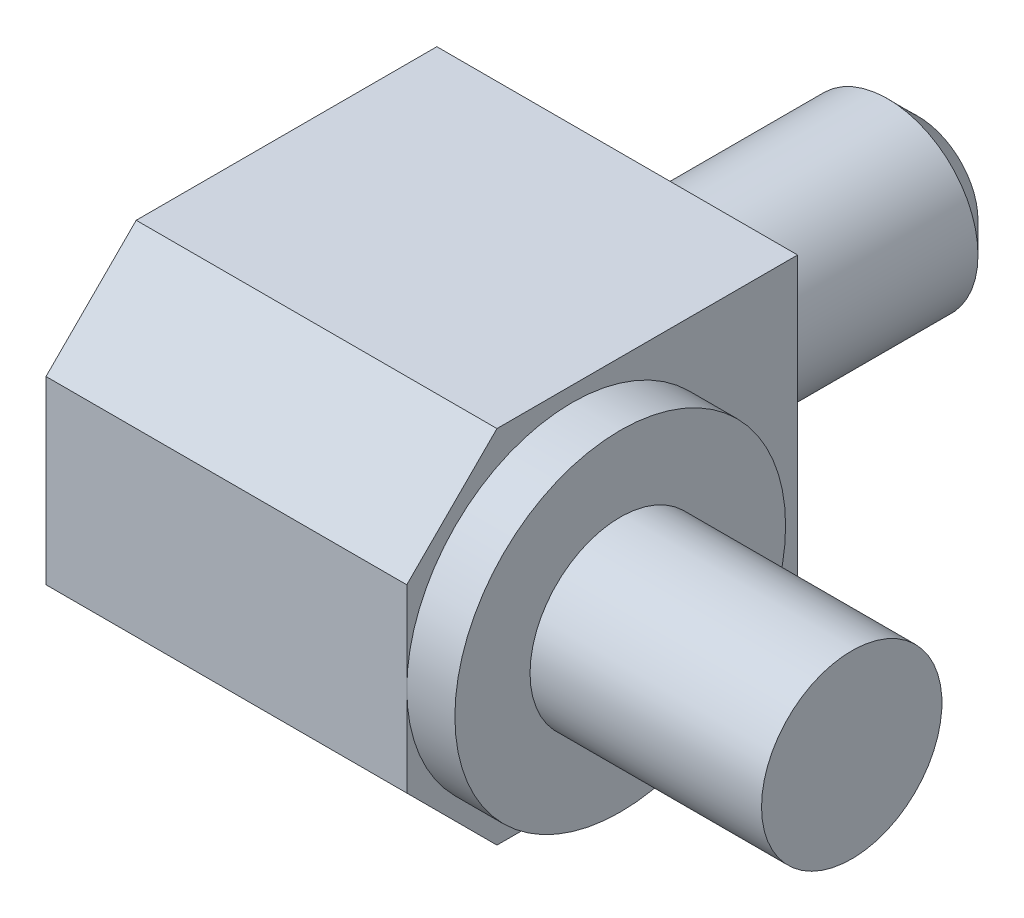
ISO-10303-21;
HEADER;
FILE_DESCRIPTION(('STEP AP214'),'2;1');
FILE_NAME('part.step','',(''),(''),'','','');
FILE_SCHEMA(('AUTOMOTIVE_DESIGN { 1 0 10303 214 1 1 1 1 }'));
ENDSEC;
DATA;
#1=APPLICATION_CONTEXT('core data for automotive mechanical design processes');
#2=APPLICATION_PROTOCOL_DEFINITION('international standard','automotive_design',2000,#1);
#3=PRODUCT_CONTEXT('',#1,'mechanical');
#4=PRODUCT('Part','Part','',(#3));
#5=PRODUCT_RELATED_PRODUCT_CATEGORY('part','',(#4));
#6=PRODUCT_DEFINITION_FORMATION('','',#4);
#7=PRODUCT_DEFINITION_CONTEXT('part definition',#1,'design');
#8=PRODUCT_DEFINITION('design','',#6,#7);
#9=PRODUCT_DEFINITION_SHAPE('','',#8);
#10=(LENGTH_UNIT() NAMED_UNIT(*) SI_UNIT(.MILLI.,.METRE.));
#11=(NAMED_UNIT(*) PLANE_ANGLE_UNIT() SI_UNIT($,.RADIAN.));
#12=(NAMED_UNIT(*) SI_UNIT($,.STERADIAN.) SOLID_ANGLE_UNIT());
#13=UNCERTAINTY_MEASURE_WITH_UNIT(LENGTH_MEASURE(1.E-05),#10,'distance_accuracy_value','');
#14=(GEOMETRIC_REPRESENTATION_CONTEXT(3) GLOBAL_UNCERTAINTY_ASSIGNED_CONTEXT((#13)) GLOBAL_UNIT_ASSIGNED_CONTEXT((#10,
#11,#12)) REPRESENTATION_CONTEXT('',''));
#15=CARTESIAN_POINT('',(0.,0.,0.));
#16=DIRECTION('',(0.,0.,1.));
#17=DIRECTION('',(1.,0.,0.));
#18=AXIS2_PLACEMENT_3D('',#15,#16,#17);
#19=CARTESIAN_POINT('',(6.,0.,0.));
#20=DIRECTION('',(1.,0.,0.));
#21=DIRECTION('',(0.,0.,-1.));
#22=AXIS2_PLACEMENT_3D('',#19,#20,#21);
#23=PLANE('',#22);
#24=DIRECTION('',(0.,1.,0.));
#25=VECTOR('',#24,1.);
#26=CARTESIAN_POINT('',(6.,-6.,13.));
#27=LINE('',#26,#25);
#28=CARTESIAN_POINT('',(6.,0.,13.));
#29=VERTEX_POINT('',#28);
#30=CARTESIAN_POINT('',(6.,2.99999999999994,13.));
#31=VERTEX_POINT('',#30);
#32=EDGE_CURVE('E76',#29,#31,#27,.T.);
#33=ORIENTED_EDGE('',*,*,#32,.F.);
#34=CARTESIAN_POINT('',(6.,0.,7.5));
#35=DIRECTION('',(-1.,0.,0.));
#36=DIRECTION('',(0.,0.,-1.));
#37=AXIS2_PLACEMENT_3D('',#34,#35,#36);
#38=CIRCLE('',#37,5.5);
#39=EDGE_CURVE('E86',#29,#29,#38,.F.);
#40=ORIENTED_EDGE('',*,*,#39,.F.);
#41=CARTESIAN_POINT('',(6.,-3.,13.));
#42=VERTEX_POINT('',#41);
#43=EDGE_CURVE('E71',#42,#29,#27,.T.);
#44=ORIENTED_EDGE('',*,*,#43,.F.);
#45=DIRECTION('',(0.,-0.707106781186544,-0.707106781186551));
#46=VECTOR('',#45,1.);
#47=CARTESIAN_POINT('',(6.,-6.,10.));
#48=LINE('',#47,#46);
#49=CARTESIAN_POINT('',(6.,-6.,10.));
#50=VERTEX_POINT('',#49);
#51=EDGE_CURVE('E114',#42,#50,#48,.T.);
#52=ORIENTED_EDGE('',*,*,#51,.T.);
#53=DIRECTION('',(0.,0.,-1.));
#54=VECTOR('',#53,1.);
#55=CARTESIAN_POINT('',(6.,-6.,13.));
#56=LINE('',#55,#54);
#57=CARTESIAN_POINT('',(6.,-6.,0.));
#58=VERTEX_POINT('',#57);
#59=EDGE_CURVE('E83',#50,#58,#56,.T.);
#60=ORIENTED_EDGE('',*,*,#59,.T.);
#61=DIRECTION('',(0.,-1.,0.));
#62=VECTOR('',#61,1.);
#63=CARTESIAN_POINT('',(6.,6.,0.));
#64=LINE('',#63,#62);
#65=CARTESIAN_POINT('',(6.,6.,0.));
#66=VERTEX_POINT('',#65);
#67=EDGE_CURVE('E97',#66,#58,#64,.T.);
#68=ORIENTED_EDGE('',*,*,#67,.F.);
#69=DIRECTION('',(0.,0.,1.));
#70=VECTOR('',#69,1.);
#71=CARTESIAN_POINT('',(6.,6.,0.));
#72=LINE('',#71,#70);
#73=CARTESIAN_POINT('',(6.,6.,10.));
#74=VERTEX_POINT('',#73);
#75=EDGE_CURVE('E91',#66,#74,#72,.T.);
#76=ORIENTED_EDGE('',*,*,#75,.T.);
#77=DIRECTION('',(0.,-0.707106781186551,0.707106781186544));
#78=VECTOR('',#77,1.);
#79=CARTESIAN_POINT('',(6.,2.99999999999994,13.));
#80=LINE('',#79,#78);
#81=EDGE_CURVE('E89',#74,#31,#80,.T.);
#82=ORIENTED_EDGE('',*,*,#81,.T.);
#83=EDGE_LOOP('',(#33,#40,#44,#52,#60,#68,#76,#82));
#84=FACE_BOUND('',#83,.T.);
#85=ADVANCED_FACE('F14',(#84),#23,.T.);
#86=CARTESIAN_POINT('',(6.,6.,0.));
#87=DIRECTION('',(0.,0.,-1.));
#88=DIRECTION('',(1.,0.,0.));
#89=AXIS2_PLACEMENT_3D('',#86,#87,#88);
#90=PLANE('',#89);
#91=CARTESIAN_POINT('',(0.,0.,0.));
#92=DIRECTION('',(0.,0.,-1.));
#93=DIRECTION('',(1.,0.,0.));
#94=AXIS2_PLACEMENT_3D('',#91,#92,#93);
#95=CIRCLE('',#94,3.);
#96=CARTESIAN_POINT('',(3.,0.,0.));
#97=VERTEX_POINT('',#96);
#98=EDGE_CURVE('E17',#97,#97,#95,.T.);
#99=ORIENTED_EDGE('',*,*,#98,.F.);
#100=EDGE_LOOP('',(#99));
#101=FACE_BOUND('',#100,.T.);
#102=DIRECTION('',(-1.,0.,0.));
#103=VECTOR('',#102,1.);
#104=CARTESIAN_POINT('',(6.,6.,0.));
#105=LINE('',#104,#103);
#106=CARTESIAN_POINT('',(-6.,6.,0.));
#107=VERTEX_POINT('',#106);
#108=EDGE_CURVE('E36',#66,#107,#105,.T.);
#109=ORIENTED_EDGE('',*,*,#108,.F.);
#110=ORIENTED_EDGE('',*,*,#67,.T.);
#111=DIRECTION('',(-1.,0.,0.));
#112=VECTOR('',#111,1.);
#113=CARTESIAN_POINT('',(6.,-6.,0.));
#114=LINE('',#113,#112);
#115=CARTESIAN_POINT('',(-6.,-6.,0.));
#116=VERTEX_POINT('',#115);
#117=EDGE_CURVE('E92',#58,#116,#114,.T.);
#118=ORIENTED_EDGE('',*,*,#117,.T.);
#119=DIRECTION('',(0.,-1.,0.));
#120=VECTOR('',#119,1.);
#121=CARTESIAN_POINT('',(-6.,6.,0.));
#122=LINE('',#121,#120);
#123=EDGE_CURVE('E9',#107,#116,#122,.T.);
#124=ORIENTED_EDGE('',*,*,#123,.F.);
#125=EDGE_LOOP('',(#109,#110,#118,#124));
#126=FACE_BOUND('',#125,.T.);
#127=ADVANCED_FACE('F125',(#101,#126),#90,.T.);
#128=CARTESIAN_POINT('',(6.,6.,0.));
#129=DIRECTION('',(0.,-1.,0.));
#130=DIRECTION('',(1.,0.,0.));
#131=AXIS2_PLACEMENT_3D('',#128,#129,#130);
#132=PLANE('',#131);
#133=DIRECTION('',(0.,0.,1.));
#134=VECTOR('',#133,1.);
#135=CARTESIAN_POINT('',(-6.,6.,0.));
#136=LINE('',#135,#134);
#137=CARTESIAN_POINT('',(-6.,6.,10.));
#138=VERTEX_POINT('',#137);
#139=EDGE_CURVE('E100',#107,#138,#136,.T.);
#140=ORIENTED_EDGE('',*,*,#139,.T.);
#141=DIRECTION('',(1.,0.,0.));
#142=VECTOR('',#141,1.);
#143=CARTESIAN_POINT('',(6.,6.,10.));
#144=LINE('',#143,#142);
#145=EDGE_CURVE('E130',#138,#74,#144,.T.);
#146=ORIENTED_EDGE('',*,*,#145,.T.);
#147=ORIENTED_EDGE('',*,*,#75,.F.);
#148=ORIENTED_EDGE('',*,*,#108,.T.);
#149=EDGE_LOOP('',(#140,#146,#147,#148));
#150=FACE_BOUND('',#149,.T.);
#151=ADVANCED_FACE('F129',(#150),#132,.F.);
#152=CARTESIAN_POINT('',(6.,-6.,13.));
#153=DIRECTION('',(0.,0.,1.));
#154=DIRECTION('',(-1.,0.,0.));
#155=AXIS2_PLACEMENT_3D('',#152,#153,#154);
#156=PLANE('',#155);
#157=DIRECTION('',(0.,1.,0.));
#158=VECTOR('',#157,1.);
#159=CARTESIAN_POINT('',(-6.,-6.,13.));
#160=LINE('',#159,#158);
#161=CARTESIAN_POINT('',(-6.,-3.,13.));
#162=VERTEX_POINT('',#161);
#163=CARTESIAN_POINT('',(-6.,2.99999999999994,13.));
#164=VERTEX_POINT('',#163);
#165=EDGE_CURVE('E102',#162,#164,#160,.T.);
#166=ORIENTED_EDGE('',*,*,#165,.F.);
#167=DIRECTION('',(1.,0.,0.));
#168=VECTOR('',#167,1.);
#169=CARTESIAN_POINT('',(6.,-3.,13.));
#170=LINE('',#169,#168);
#171=EDGE_CURVE('E79',#162,#42,#170,.T.);
#172=ORIENTED_EDGE('',*,*,#171,.T.);
#173=ORIENTED_EDGE('',*,*,#43,.T.);
#174=ORIENTED_EDGE('',*,*,#32,.T.);
#175=DIRECTION('',(-1.,0.,0.));
#176=VECTOR('',#175,1.);
#177=CARTESIAN_POINT('',(-6.,2.99999999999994,13.));
#178=LINE('',#177,#176);
#179=EDGE_CURVE('E110',#31,#164,#178,.T.);
#180=ORIENTED_EDGE('',*,*,#179,.T.);
#181=EDGE_LOOP('',(#166,#172,#173,#174,#180));
#182=FACE_BOUND('',#181,.T.);
#183=ADVANCED_FACE('F74',(#182),#156,.T.);
#184=CARTESIAN_POINT('',(6.,-6.,13.));
#185=DIRECTION('',(0.,1.,0.));
#186=DIRECTION('',(0.,0.,1.));
#187=AXIS2_PLACEMENT_3D('',#184,#185,#186);
#188=PLANE('',#187);
#189=ORIENTED_EDGE('',*,*,#59,.F.);
#190=DIRECTION('',(-1.,0.,0.));
#191=VECTOR('',#190,1.);
#192=CARTESIAN_POINT('',(-6.,-6.,10.));
#193=LINE('',#192,#191);
#194=CARTESIAN_POINT('',(-6.,-6.,10.));
#195=VERTEX_POINT('',#194);
#196=EDGE_CURVE('E122',#50,#195,#193,.T.);
#197=ORIENTED_EDGE('',*,*,#196,.T.);
#198=DIRECTION('',(0.,0.,-1.));
#199=VECTOR('',#198,1.);
#200=CARTESIAN_POINT('',(-6.,-6.,13.));
#201=LINE('',#200,#199);
#202=EDGE_CURVE('E22',#195,#116,#201,.T.);
#203=ORIENTED_EDGE('',*,*,#202,.T.);
#204=ORIENTED_EDGE('',*,*,#117,.F.);
#205=EDGE_LOOP('',(#189,#197,#203,#204));
#206=FACE_BOUND('',#205,.T.);
#207=ADVANCED_FACE('F181',(#206),#188,.F.);
#208=CARTESIAN_POINT('',(-6.,6.,0.));
#209=DIRECTION('',(-1.,0.,0.));
#210=DIRECTION('',(0.,0.,-1.));
#211=AXIS2_PLACEMENT_3D('',#208,#209,#210);
#212=PLANE('',#211);
#213=ORIENTED_EDGE('',*,*,#202,.F.);
#214=DIRECTION('',(0.,0.707106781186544,0.707106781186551));
#215=VECTOR('',#214,1.);
#216=CARTESIAN_POINT('',(-6.,-5.,11.));
#217=LINE('',#216,#215);
#218=EDGE_CURVE('E109',#195,#162,#217,.T.);
#219=ORIENTED_EDGE('',*,*,#218,.T.);
#220=ORIENTED_EDGE('',*,*,#165,.T.);
#221=DIRECTION('',(0.,0.707106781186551,-0.707106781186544));
#222=VECTOR('',#221,1.);
#223=CARTESIAN_POINT('',(-6.,11.,5.));
#224=LINE('',#223,#222);
#225=EDGE_CURVE('E108',#164,#138,#224,.T.);
#226=ORIENTED_EDGE('',*,*,#225,.T.);
#227=ORIENTED_EDGE('',*,*,#139,.F.);
#228=ORIENTED_EDGE('',*,*,#123,.T.);
#229=EDGE_LOOP('',(#213,#219,#220,#226,#227,#228));
#230=FACE_BOUND('',#229,.T.);
#231=ADVANCED_FACE('F106',(#230),#212,.T.);
#232=CARTESIAN_POINT('',(6.,-6.,10.));
#233=DIRECTION('',(0.,-0.707106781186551,0.707106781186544));
#234=DIRECTION('',(0.,-0.707106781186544,-0.707106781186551));
#235=AXIS2_PLACEMENT_3D('',#232,#233,#234);
#236=PLANE('',#235);
#237=ORIENTED_EDGE('',*,*,#51,.F.);
#238=ORIENTED_EDGE('',*,*,#171,.F.);
#239=ORIENTED_EDGE('',*,*,#218,.F.);
#240=ORIENTED_EDGE('',*,*,#196,.F.);
#241=EDGE_LOOP('',(#237,#238,#239,#240));
#242=FACE_BOUND('',#241,.T.);
#243=ADVANCED_FACE('F112',(#242),#236,.T.);
#244=CARTESIAN_POINT('',(6.,2.99999999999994,13.));
#245=DIRECTION('',(0.,0.707106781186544,0.707106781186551));
#246=DIRECTION('',(0.,-0.707106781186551,0.707106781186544));
#247=AXIS2_PLACEMENT_3D('',#244,#245,#246);
#248=PLANE('',#247);
#249=ORIENTED_EDGE('',*,*,#81,.F.);
#250=ORIENTED_EDGE('',*,*,#145,.F.);
#251=ORIENTED_EDGE('',*,*,#225,.F.);
#252=ORIENTED_EDGE('',*,*,#179,.F.);
#253=EDGE_LOOP('',(#249,#250,#251,#252));
#254=FACE_BOUND('',#253,.T.);
#255=ADVANCED_FACE('F132',(#254),#248,.T.);
#256=CARTESIAN_POINT('',(0.,0.,-10.));
#257=DIRECTION('',(0.,0.,1.));
#258=DIRECTION('',(-1.,0.,0.));
#259=AXIS2_PLACEMENT_3D('',#256,#257,#258);
#260=CYLINDRICAL_SURFACE('',#259,3.);
#261=CARTESIAN_POINT('',(0.,0.,-9.));
#262=DIRECTION('',(0.,0.,-1.));
#263=DIRECTION('',(1.,0.,0.));
#264=AXIS2_PLACEMENT_3D('',#261,#262,#263);
#265=CIRCLE('',#264,3.);
#266=CARTESIAN_POINT('',(3.,0.,-9.));
#267=VERTEX_POINT('',#266);
#268=EDGE_CURVE('E139',#267,#267,#265,.F.);
#269=ORIENTED_EDGE('',*,*,#268,.T.);
#270=EDGE_LOOP('',(#269));
#271=FACE_BOUND('',#270,.T.);
#272=ORIENTED_EDGE('',*,*,#98,.T.);
#273=EDGE_LOOP('',(#272));
#274=FACE_BOUND('',#273,.T.);
#275=ADVANCED_FACE('F189',(#271,#274),#260,.T.);
#276=CARTESIAN_POINT('',(0.,0.,-10.));
#277=DIRECTION('',(0.,0.,-1.));
#278=DIRECTION('',(1.,0.,0.));
#279=AXIS2_PLACEMENT_3D('',#276,#277,#278);
#280=PLANE('',#279);
#281=CARTESIAN_POINT('',(0.,0.,-10.));
#282=DIRECTION('',(0.,0.,-1.));
#283=DIRECTION('',(1.,0.,0.));
#284=AXIS2_PLACEMENT_3D('',#281,#282,#283);
#285=CIRCLE('',#284,2.);
#286=CARTESIAN_POINT('',(2.,0.,-10.));
#287=VERTEX_POINT('',#286);
#288=EDGE_CURVE('E135',#287,#287,#285,.T.);
#289=ORIENTED_EDGE('',*,*,#288,.T.);
#290=EDGE_LOOP('',(#289));
#291=FACE_BOUND('',#290,.T.);
#292=ADVANCED_FACE('F190',(#291),#280,.T.);
#293=CARTESIAN_POINT('',(0.,0.,-10.));
#294=DIRECTION('',(0.,0.,1.));
#295=DIRECTION('',(-1.,0.,0.));
#296=AXIS2_PLACEMENT_3D('',#293,#294,#295);
#297=CONICAL_SURFACE('',#296,2.,0.785398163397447);
#298=ORIENTED_EDGE('',*,*,#268,.F.);
#299=EDGE_LOOP('',(#298));
#300=FACE_BOUND('',#299,.T.);
#301=ORIENTED_EDGE('',*,*,#288,.F.);
#302=EDGE_LOOP('',(#301));
#303=FACE_BOUND('',#302,.T.);
#304=ADVANCED_FACE('F169',(#300,#303),#297,.T.);
#305=CARTESIAN_POINT('',(15.3,0.,7.5));
#306=DIRECTION('',(1.,0.,0.));
#307=DIRECTION('',(0.,0.,1.));
#308=AXIS2_PLACEMENT_3D('',#305,#306,#307);
#309=PLANE('',#308);
#310=CARTESIAN_POINT('',(15.3,0.,7.5));
#311=DIRECTION('',(1.,0.,0.));
#312=DIRECTION('',(0.,0.,1.));
#313=AXIS2_PLACEMENT_3D('',#310,#311,#312);
#314=CIRCLE('',#313,3.);
#315=CARTESIAN_POINT('',(15.3,0.,10.5));
#316=VERTEX_POINT('',#315);
#317=EDGE_CURVE('E143',#316,#316,#314,.T.);
#318=ORIENTED_EDGE('',*,*,#317,.T.);
#319=EDGE_LOOP('',(#318));
#320=FACE_BOUND('',#319,.T.);
#321=ADVANCED_FACE('F199',(#320),#309,.T.);
#322=CARTESIAN_POINT('',(15.3,0.,7.5));
#323=DIRECTION('',(-1.,0.,0.));
#324=DIRECTION('',(0.,0.,-1.));
#325=AXIS2_PLACEMENT_3D('',#322,#323,#324);
#326=CYLINDRICAL_SURFACE('',#325,3.);
#327=CARTESIAN_POINT('',(7.6,0.,7.5));
#328=DIRECTION('',(1.,0.,0.));
#329=DIRECTION('',(0.,0.,1.));
#330=AXIS2_PLACEMENT_3D('',#327,#328,#329);
#331=CIRCLE('',#330,3.);
#332=CARTESIAN_POINT('',(7.6,0.,10.5));
#333=VERTEX_POINT('',#332);
#334=EDGE_CURVE('E144',#333,#333,#331,.T.);
#335=ORIENTED_EDGE('',*,*,#334,.T.);
#336=EDGE_LOOP('',(#335));
#337=FACE_BOUND('',#336,.T.);
#338=ORIENTED_EDGE('',*,*,#317,.F.);
#339=EDGE_LOOP('',(#338));
#340=FACE_BOUND('',#339,.T.);
#341=ADVANCED_FACE('F165',(#337,#340),#326,.T.);
#342=CARTESIAN_POINT('',(7.6,0.,7.5));
#343=DIRECTION('',(1.,0.,0.));
#344=DIRECTION('',(0.,0.,1.));
#345=AXIS2_PLACEMENT_3D('',#342,#343,#344);
#346=PLANE('',#345);
#347=CARTESIAN_POINT('',(7.6,0.,7.5));
#348=DIRECTION('',(1.,0.,0.));
#349=DIRECTION('',(0.,0.,1.));
#350=AXIS2_PLACEMENT_3D('',#347,#348,#349);
#351=CIRCLE('',#350,5.5);
#352=CARTESIAN_POINT('',(7.6,0.,13.));
#353=VERTEX_POINT('',#352);
#354=EDGE_CURVE('E147',#353,#353,#351,.T.);
#355=ORIENTED_EDGE('',*,*,#354,.T.);
#356=EDGE_LOOP('',(#355));
#357=FACE_BOUND('',#356,.T.);
#358=ORIENTED_EDGE('',*,*,#334,.F.);
#359=EDGE_LOOP('',(#358));
#360=FACE_BOUND('',#359,.T.);
#361=ADVANCED_FACE('F153',(#357,#360),#346,.T.);
#362=CARTESIAN_POINT('',(7.6,0.,7.5));
#363=DIRECTION('',(-1.,0.,0.));
#364=DIRECTION('',(0.,0.,-1.));
#365=AXIS2_PLACEMENT_3D('',#362,#363,#364);
#366=CYLINDRICAL_SURFACE('',#365,5.5);
#367=ORIENTED_EDGE('',*,*,#354,.F.);
#368=EDGE_LOOP('',(#367));
#369=FACE_BOUND('',#368,.T.);
#370=ORIENTED_EDGE('',*,*,#39,.T.);
#371=EDGE_LOOP('',(#370));
#372=FACE_BOUND('',#371,.T.);
#373=ADVANCED_FACE('F156',(#369,#372),#366,.T.);
#374=CLOSED_SHELL('',(#85,#127,#151,#183,#207,#231,#243,#255,#275,#292,#304,#321,#341,#361,#373));
#375=MANIFOLD_SOLID_BREP('B1',#374);
#376=ADVANCED_BREP_SHAPE_REPRESENTATION('',(#18,#375),#14);
#377=SHAPE_DEFINITION_REPRESENTATION(#9,#376);
ENDSEC;
END-ISO-10303-21;
